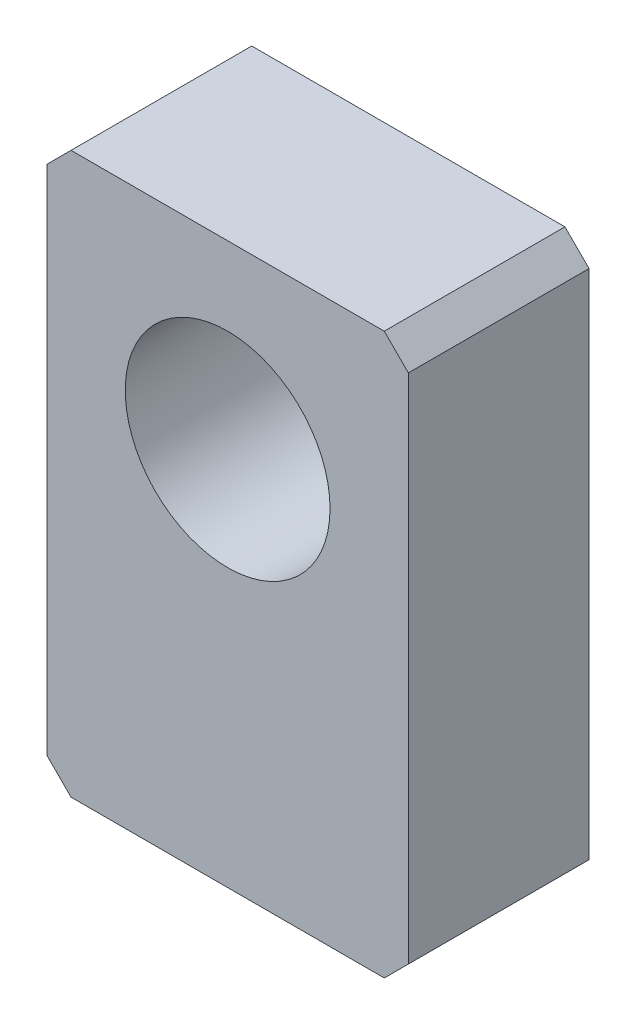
from build123d import *

# Parameters (mm, degrees)
SKETCH_1_R                   = 1.7
EDGE_CLIP_M3_CLEARANCE_DEPTH = 3


with BuildPart() as part:
    # Sketch 1 → Edge_clip_M3_clearance (new body)
    with BuildSketch(Plane.XY):
        Polygon((-2.6, -6.3), (2.6, -6.3), (3, -5.9), (3, 2.6), (2.6, 3), (-2.6, 3), (-3, 2.6), (-3, -5.9), align=None)
        Circle(SKETCH_1_R, mode=Mode.SUBTRACT)
    extrude(amount=EDGE_CLIP_M3_CLEARANCE_DEPTH)


solid = part.part
